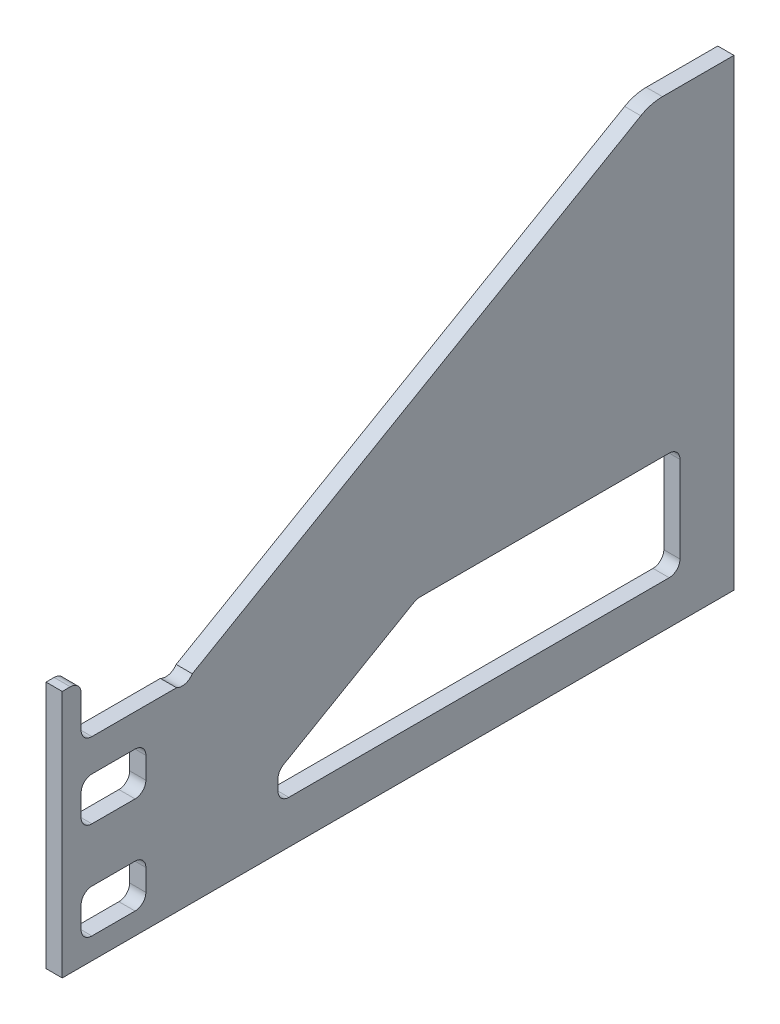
ISO-10303-21;
HEADER;
FILE_DESCRIPTION(('STEP AP214'),'2;1');
FILE_NAME('part.step','',(''),(''),'','','');
FILE_SCHEMA(('AUTOMOTIVE_DESIGN { 1 0 10303 214 1 1 1 1 }'));
ENDSEC;
DATA;
#1=APPLICATION_CONTEXT('core data for automotive mechanical design processes');
#2=APPLICATION_PROTOCOL_DEFINITION('international standard','automotive_design',2000,#1);
#3=PRODUCT_CONTEXT('',#1,'mechanical');
#4=PRODUCT('Part','Part','',(#3));
#5=PRODUCT_RELATED_PRODUCT_CATEGORY('part','',(#4));
#6=PRODUCT_DEFINITION_FORMATION('','',#4);
#7=PRODUCT_DEFINITION_CONTEXT('part definition',#1,'design');
#8=PRODUCT_DEFINITION('design','',#6,#7);
#9=PRODUCT_DEFINITION_SHAPE('','',#8);
#10=(LENGTH_UNIT() NAMED_UNIT(*) SI_UNIT(.MILLI.,.METRE.));
#11=(NAMED_UNIT(*) PLANE_ANGLE_UNIT() SI_UNIT($,.RADIAN.));
#12=(NAMED_UNIT(*) SI_UNIT($,.STERADIAN.) SOLID_ANGLE_UNIT());
#13=UNCERTAINTY_MEASURE_WITH_UNIT(LENGTH_MEASURE(1.E-05),#10,'distance_accuracy_value','');
#14=(GEOMETRIC_REPRESENTATION_CONTEXT(3) GLOBAL_UNCERTAINTY_ASSIGNED_CONTEXT((#13)) GLOBAL_UNIT_ASSIGNED_CONTEXT((#10,
#11,#12)) REPRESENTATION_CONTEXT('',''));
#15=CARTESIAN_POINT('',(0.,0.,0.));
#16=DIRECTION('',(0.,0.,1.));
#17=DIRECTION('',(1.,0.,0.));
#18=AXIS2_PLACEMENT_3D('',#15,#16,#17);
#19=CARTESIAN_POINT('',(4.7625,114.3,0.));
#20=DIRECTION('',(0.,-1.,0.));
#21=DIRECTION('',(0.,0.,-1.));
#22=AXIS2_PLACEMENT_3D('',#19,#20,#21);
#23=PLANE('',#22);
#24=DIRECTION('',(0.,0.,1.));
#25=VECTOR('',#24,1.);
#26=CARTESIAN_POINT('',(4.7625,114.3,0.));
#27=LINE('',#26,#25);
#28=CARTESIAN_POINT('',(4.7625,114.3,45.4431678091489));
#29=VERTEX_POINT('',#28);
#30=CARTESIAN_POINT('',(4.7625,114.3,95.2500000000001));
#31=VERTEX_POINT('',#30);
#32=EDGE_CURVE('E288',#29,#31,#27,.T.);
#33=ORIENTED_EDGE('',*,*,#32,.F.);
#34=DIRECTION('',(1.,0.,0.));
#35=VECTOR('',#34,1.);
#36=CARTESIAN_POINT('',(-4.7625,114.3,45.4431678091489));
#37=LINE('',#36,#35);
#38=CARTESIAN_POINT('',(-4.7625,114.3,45.4431678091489));
#39=VERTEX_POINT('',#38);
#40=EDGE_CURVE('E275',#29,#39,#37,.F.);
#41=ORIENTED_EDGE('',*,*,#40,.T.);
#42=DIRECTION('',(0.,0.,1.));
#43=VECTOR('',#42,1.);
#44=CARTESIAN_POINT('',(-4.7625,114.3,0.));
#45=LINE('',#44,#43);
#46=CARTESIAN_POINT('',(-4.7625,114.3,95.2500000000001));
#47=VERTEX_POINT('',#46);
#48=EDGE_CURVE('E315',#39,#47,#45,.T.);
#49=ORIENTED_EDGE('',*,*,#48,.T.);
#50=DIRECTION('',(-1.,0.,0.));
#51=VECTOR('',#50,1.);
#52=CARTESIAN_POINT('',(4.7625,114.3,95.2500000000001));
#53=LINE('',#52,#51);
#54=EDGE_CURVE('E294',#47,#31,#53,.F.);
#55=ORIENTED_EDGE('',*,*,#54,.T.);
#56=EDGE_LOOP('',(#33,#41,#49,#55));
#57=FACE_BOUND('',#56,.T.);
#58=ADVANCED_FACE('F33',(#57),#23,.F.);
#59=CARTESIAN_POINT('',(4.7625,114.3,112.7125));
#60=DIRECTION('',(0.,0.,-1.));
#61=DIRECTION('',(0.,1.,0.));
#62=AXIS2_PLACEMENT_3D('',#59,#60,#61);
#63=PLANE('',#62);
#64=DIRECTION('',(0.,-1.,0.));
#65=VECTOR('',#64,1.);
#66=CARTESIAN_POINT('',(-4.7625,114.3,112.7125));
#67=LINE('',#66,#65);
#68=CARTESIAN_POINT('',(-4.7625,146.05,112.7125));
#69=VERTEX_POINT('',#68);
#70=CARTESIAN_POINT('',(-4.7625,0.,112.7125));
#71=VERTEX_POINT('',#70);
#72=EDGE_CURVE('E317',#69,#71,#67,.T.);
#73=ORIENTED_EDGE('',*,*,#72,.T.);
#74=DIRECTION('',(-1.,0.,0.));
#75=VECTOR('',#74,1.);
#76=CARTESIAN_POINT('',(4.7625,0.,112.7125));
#77=LINE('',#76,#75);
#78=CARTESIAN_POINT('',(4.7625,0.,112.7125));
#79=VERTEX_POINT('',#78);
#80=EDGE_CURVE('E331',#79,#71,#77,.T.);
#81=ORIENTED_EDGE('',*,*,#80,.F.);
#82=DIRECTION('',(0.,-1.,0.));
#83=VECTOR('',#82,1.);
#84=CARTESIAN_POINT('',(4.7625,114.3,112.7125));
#85=LINE('',#84,#83);
#86=CARTESIAN_POINT('',(4.76250000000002,146.05,112.7125));
#87=VERTEX_POINT('',#86);
#88=EDGE_CURVE('E295',#87,#79,#85,.T.);
#89=ORIENTED_EDGE('',*,*,#88,.F.);
#90=DIRECTION('',(-1.,0.,0.));
#91=VECTOR('',#90,1.);
#92=CARTESIAN_POINT('',(38.4010219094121,146.05,112.7125));
#93=LINE('',#92,#91);
#94=EDGE_CURVE('E374',#87,#69,#93,.T.);
#95=ORIENTED_EDGE('',*,*,#94,.T.);
#96=EDGE_LOOP('',(#73,#81,#89,#95));
#97=FACE_BOUND('',#96,.T.);
#98=ADVANCED_FACE('F624',(#97),#63,.F.);
#99=CARTESIAN_POINT('',(4.7625,0.,112.7125));
#100=DIRECTION('',(0.,1.,0.));
#101=DIRECTION('',(0.,0.,1.));
#102=AXIS2_PLACEMENT_3D('',#99,#100,#101);
#103=PLANE('',#102);
#104=DIRECTION('',(0.,0.,-1.));
#105=VECTOR('',#104,1.);
#106=CARTESIAN_POINT('',(-4.7625,0.,112.7125));
#107=LINE('',#106,#105);
#108=CARTESIAN_POINT('',(-4.7625,0.,-282.575));
#109=VERTEX_POINT('',#108);
#110=EDGE_CURVE('E320',#71,#109,#107,.T.);
#111=ORIENTED_EDGE('',*,*,#110,.T.);
#112=DIRECTION('',(-1.,0.,0.));
#113=VECTOR('',#112,1.);
#114=CARTESIAN_POINT('',(4.7625,0.,-282.575));
#115=LINE('',#114,#113);
#116=CARTESIAN_POINT('',(4.7625,0.,-282.575));
#117=VERTEX_POINT('',#116);
#118=EDGE_CURVE('E328',#117,#109,#115,.T.);
#119=ORIENTED_EDGE('',*,*,#118,.F.);
#120=DIRECTION('',(0.,0.,-1.));
#121=VECTOR('',#120,1.);
#122=CARTESIAN_POINT('',(4.7625,0.,112.7125));
#123=LINE('',#122,#121);
#124=EDGE_CURVE('E298',#79,#117,#123,.T.);
#125=ORIENTED_EDGE('',*,*,#124,.F.);
#126=ORIENTED_EDGE('',*,*,#80,.T.);
#127=EDGE_LOOP('',(#111,#119,#125,#126));
#128=FACE_BOUND('',#127,.T.);
#129=ADVANCED_FACE('F629',(#128),#103,.F.);
#130=CARTESIAN_POINT('',(4.7625,0.,-282.575));
#131=DIRECTION('',(0.,0.,1.));
#132=DIRECTION('',(1.,0.,0.));
#133=AXIS2_PLACEMENT_3D('',#130,#131,#132);
#134=PLANE('',#133);
#135=DIRECTION('',(0.,1.,0.));
#136=VECTOR('',#135,1.);
#137=CARTESIAN_POINT('',(-4.7625,0.,-282.575));
#138=LINE('',#137,#136);
#139=CARTESIAN_POINT('',(-4.7625,272.576458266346,-282.575));
#140=VERTEX_POINT('',#139);
#141=EDGE_CURVE('E322',#109,#140,#138,.T.);
#142=ORIENTED_EDGE('',*,*,#141,.T.);
#143=DIRECTION('',(-1.,0.,0.));
#144=VECTOR('',#143,1.);
#145=CARTESIAN_POINT('',(4.7625,272.576458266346,-282.575));
#146=LINE('',#145,#144);
#147=CARTESIAN_POINT('',(4.7625,272.576458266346,-282.575));
#148=VERTEX_POINT('',#147);
#149=EDGE_CURVE('E314',#148,#140,#146,.T.);
#150=ORIENTED_EDGE('',*,*,#149,.F.);
#151=DIRECTION('',(0.,1.,0.));
#152=VECTOR('',#151,1.);
#153=CARTESIAN_POINT('',(4.7625,0.,-282.575));
#154=LINE('',#153,#152);
#155=EDGE_CURVE('E308',#117,#148,#154,.T.);
#156=ORIENTED_EDGE('',*,*,#155,.F.);
#157=ORIENTED_EDGE('',*,*,#118,.T.);
#158=EDGE_LOOP('',(#142,#150,#156,#157));
#159=FACE_BOUND('',#158,.T.);
#160=ADVANCED_FACE('F668',(#159),#134,.F.);
#161=CARTESIAN_POINT('',(4.7625,272.576458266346,-282.575));
#162=DIRECTION('',(0.,-1.,0.));
#163=DIRECTION('',(0.,0.,-1.));
#164=AXIS2_PLACEMENT_3D('',#161,#162,#163);
#165=PLANE('',#164);
#166=DIRECTION('',(0.,0.,1.));
#167=VECTOR('',#166,1.);
#168=CARTESIAN_POINT('',(-4.7625,272.576458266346,-282.575));
#169=LINE('',#168,#167);
#170=CARTESIAN_POINT('',(-4.7625,272.576458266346,-240.479801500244));
#171=VERTEX_POINT('',#170);
#172=EDGE_CURVE('E301',#140,#171,#169,.T.);
#173=ORIENTED_EDGE('',*,*,#172,.T.);
#174=DIRECTION('',(-1.,0.,0.));
#175=VECTOR('',#174,1.);
#176=CARTESIAN_POINT('',(4.7625,272.576458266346,-240.479801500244));
#177=LINE('',#176,#175);
#178=CARTESIAN_POINT('',(4.7625,272.576458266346,-240.479801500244));
#179=VERTEX_POINT('',#178);
#180=EDGE_CURVE('E348',#171,#179,#177,.F.);
#181=ORIENTED_EDGE('',*,*,#180,.T.);
#182=DIRECTION('',(0.,0.,1.));
#183=VECTOR('',#182,1.);
#184=CARTESIAN_POINT('',(4.7625,272.576458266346,-282.575));
#185=LINE('',#184,#183);
#186=EDGE_CURVE('E310',#148,#179,#185,.T.);
#187=ORIENTED_EDGE('',*,*,#186,.F.);
#188=ORIENTED_EDGE('',*,*,#149,.T.);
#189=EDGE_LOOP('',(#173,#181,#187,#188));
#190=FACE_BOUND('',#189,.T.);
#191=ADVANCED_FACE('F671',(#190),#165,.F.);
#192=CARTESIAN_POINT('',(4.7625,272.576458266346,-233.673892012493));
#193=DIRECTION('',(0.,-0.866025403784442,-0.499999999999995));
#194=DIRECTION('',(0.,0.499999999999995,-0.866025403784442));
#195=AXIS2_PLACEMENT_3D('',#192,#193,#194);
#196=PLANE('',#195);
#197=DIRECTION('',(0.,-0.499999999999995,0.866025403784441));
#198=VECTOR('',#197,1.);
#199=CARTESIAN_POINT('',(-4.7625,272.576458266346,-233.673892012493));
#200=LINE('',#199,#198);
#201=CARTESIAN_POINT('',(-4.7625,269.173503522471,-227.779801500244));
#202=VERTEX_POINT('',#201);
#203=CARTESIAN_POINT('',(-4.7625,116.787096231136,36.1611983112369));
#204=VERTEX_POINT('',#203);
#205=EDGE_CURVE('E296',#202,#204,#200,.T.);
#206=ORIENTED_EDGE('',*,*,#205,.T.);
#207=DIRECTION('',(1.,0.,0.));
#208=VECTOR('',#207,1.);
#209=CARTESIAN_POINT('',(-4.7625,116.787096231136,36.1611983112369));
#210=LINE('',#209,#208);
#211=CARTESIAN_POINT('',(4.7625,116.787096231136,36.1611983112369));
#212=VERTEX_POINT('',#211);
#213=EDGE_CURVE('E48',#204,#212,#210,.T.);
#214=ORIENTED_EDGE('',*,*,#213,.T.);
#215=DIRECTION('',(0.,-0.499999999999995,0.866025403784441));
#216=VECTOR('',#215,1.);
#217=CARTESIAN_POINT('',(4.7625,272.576458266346,-233.673892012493));
#218=LINE('',#217,#216);
#219=CARTESIAN_POINT('',(4.7625,269.173503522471,-227.779801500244));
#220=VERTEX_POINT('',#219);
#221=EDGE_CURVE('E291',#220,#212,#218,.T.);
#222=ORIENTED_EDGE('',*,*,#221,.F.);
#223=DIRECTION('',(-1.,0.,0.));
#224=VECTOR('',#223,1.);
#225=CARTESIAN_POINT('',(4.7625,269.173503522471,-227.779801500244));
#226=LINE('',#225,#224);
#227=EDGE_CURVE('E343',#220,#202,#226,.T.);
#228=ORIENTED_EDGE('',*,*,#227,.T.);
#229=EDGE_LOOP('',(#206,#214,#222,#228));
#230=FACE_BOUND('',#229,.T.);
#231=ADVANCED_FACE('F648',(#230),#196,.F.);
#232=CARTESIAN_POINT('',(4.7625,0.,0.));
#233=DIRECTION('',(1.,0.,0.));
#234=DIRECTION('',(0.,0.,-1.));
#235=AXIS2_PLACEMENT_3D('',#232,#233,#234);
#236=PLANE('',#235);
#237=CARTESIAN_POINT('',(4.7625,120.65,42.1704527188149));
#238=DIRECTION('',(1.,0.,0.));
#239=DIRECTION('',(0.,0.,-1.));
#240=AXIS2_PLACEMENT_3D('',#237,#238,#239);
#241=CIRCLE('',#240,7.14375000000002);
#242=EDGE_CURVE('E278',#29,#212,#241,.T.);
#243=ORIENTED_EDGE('',*,*,#242,.F.);
#244=ORIENTED_EDGE('',*,*,#32,.T.);
#245=CARTESIAN_POINT('',(4.7625,120.65,95.2500000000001));
#246=DIRECTION('',(1.,0.,0.));
#247=DIRECTION('',(0.,0.,-1.));
#248=AXIS2_PLACEMENT_3D('',#245,#246,#247);
#249=CIRCLE('',#248,6.35);
#250=CARTESIAN_POINT('',(4.7625,120.65,101.6));
#251=VERTEX_POINT('',#250);
#252=EDGE_CURVE('E11',#31,#251,#249,.F.);
#253=ORIENTED_EDGE('',*,*,#252,.T.);
#254=DIRECTION('',(0.,-1.,0.));
#255=VECTOR('',#254,1.);
#256=CARTESIAN_POINT('',(4.7625,146.05,101.6));
#257=LINE('',#256,#255);
#258=CARTESIAN_POINT('',(4.7625,139.7,101.6));
#259=VERTEX_POINT('',#258);
#260=EDGE_CURVE('E366',#259,#251,#257,.T.);
#261=ORIENTED_EDGE('',*,*,#260,.F.);
#262=CARTESIAN_POINT('',(4.7625,139.7,107.95));
#263=DIRECTION('',(1.,0.,0.));
#264=DIRECTION('',(0.,0.,-1.));
#265=AXIS2_PLACEMENT_3D('',#262,#263,#264);
#266=CIRCLE('',#265,6.35);
#267=CARTESIAN_POINT('',(4.7625,146.05,107.95));
#268=VERTEX_POINT('',#267);
#269=EDGE_CURVE('E341',#259,#268,#266,.T.);
#270=ORIENTED_EDGE('',*,*,#269,.T.);
#271=DIRECTION('',(0.,0.,-1.));
#272=VECTOR('',#271,1.);
#273=CARTESIAN_POINT('',(4.7625,146.05,112.7125));
#274=LINE('',#273,#272);
#275=EDGE_CURVE('E369',#87,#268,#274,.T.);
#276=ORIENTED_EDGE('',*,*,#275,.F.);
#277=ORIENTED_EDGE('',*,*,#88,.T.);
#278=ORIENTED_EDGE('',*,*,#124,.T.);
#279=ORIENTED_EDGE('',*,*,#155,.T.);
#280=ORIENTED_EDGE('',*,*,#186,.T.);
#281=CARTESIAN_POINT('',(4.7625,247.176458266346,-240.479801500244));
#282=DIRECTION('',(1.,0.,0.));
#283=DIRECTION('',(0.,0.,-1.));
#284=AXIS2_PLACEMENT_3D('',#281,#282,#283);
#285=CIRCLE('',#284,25.4);
#286=EDGE_CURVE('E350',#179,#220,#285,.T.);
#287=ORIENTED_EDGE('',*,*,#286,.T.);
#288=ORIENTED_EDGE('',*,*,#221,.T.);
#289=EDGE_LOOP('',(#243,#244,#253,#261,#270,#276,#277,#278,#279,#280,#287,#288));
#290=FACE_BOUND('',#289,.T.);
#291=CARTESIAN_POINT('',(4.7625,82.55,-97.6271583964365));
#292=DIRECTION('',(1.,0.,0.));
#293=DIRECTION('',(0.,0.,-1.));
#294=AXIS2_PLACEMENT_3D('',#291,#292,#293);
#295=CIRCLE('',#294,6.34999999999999);
#296=CARTESIAN_POINT('',(4.7625,88.9,-97.6271583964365));
#297=VERTEX_POINT('',#296);
#298=CARTESIAN_POINT('',(4.7625,88.0492613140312,-94.4521583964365));
#299=VERTEX_POINT('',#298);
#300=EDGE_CURVE('E368',#297,#299,#295,.T.);
#301=ORIENTED_EDGE('',*,*,#300,.F.);
#302=DIRECTION('',(0.,0.,1.));
#303=VECTOR('',#302,1.);
#304=CARTESIAN_POINT('',(4.7625,88.9,-97.6271583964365));
#305=LINE('',#304,#303);
#306=CARTESIAN_POINT('',(4.7625,88.9,-244.475));
#307=VERTEX_POINT('',#306);
#308=EDGE_CURVE('E385',#307,#297,#305,.T.);
#309=ORIENTED_EDGE('',*,*,#308,.F.);
#310=CARTESIAN_POINT('',(4.7625,82.55,-244.475));
#311=DIRECTION('',(1.,0.,0.));
#312=DIRECTION('',(0.,0.,-1.));
#313=AXIS2_PLACEMENT_3D('',#310,#311,#312);
#314=CIRCLE('',#313,6.34999999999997);
#315=CARTESIAN_POINT('',(4.7625,82.55,-250.825));
#316=VERTEX_POINT('',#315);
#317=EDGE_CURVE('E433',#316,#307,#314,.T.);
#318=ORIENTED_EDGE('',*,*,#317,.F.);
#319=DIRECTION('',(0.,1.,0.));
#320=VECTOR('',#319,1.);
#321=CARTESIAN_POINT('',(4.7625,82.55,-250.825));
#322=LINE('',#321,#320);
#323=CARTESIAN_POINT('',(4.7625,31.75,-250.825));
#324=VERTEX_POINT('',#323);
#325=EDGE_CURVE('E430',#324,#316,#322,.T.);
#326=ORIENTED_EDGE('',*,*,#325,.F.);
#327=CARTESIAN_POINT('',(4.7625,31.75,-244.475));
#328=DIRECTION('',(1.,0.,0.));
#329=DIRECTION('',(0.,0.,-1.));
#330=AXIS2_PLACEMENT_3D('',#327,#328,#329);
#331=CIRCLE('',#330,6.34999999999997);
#332=CARTESIAN_POINT('',(4.7625,25.4,-244.475));
#333=VERTEX_POINT('',#332);
#334=EDGE_CURVE('E427',#333,#324,#331,.T.);
#335=ORIENTED_EDGE('',*,*,#334,.F.);
#336=DIRECTION('',(0.,0.,-1.));
#337=VECTOR('',#336,1.);
#338=CARTESIAN_POINT('',(4.7625,25.4,-20.6374999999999));
#339=LINE('',#338,#337);
#340=CARTESIAN_POINT('',(4.7625,25.4,-20.6374999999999));
#341=VERTEX_POINT('',#340);
#342=EDGE_CURVE('E424',#341,#333,#339,.T.);
#343=ORIENTED_EDGE('',*,*,#342,.F.);
#344=CARTESIAN_POINT('',(4.7625,31.75,-20.6374999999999));
#345=DIRECTION('',(1.,0.,0.));
#346=DIRECTION('',(0.,0.,-1.));
#347=AXIS2_PLACEMENT_3D('',#344,#345,#346);
#348=CIRCLE('',#347,6.35);
#349=CARTESIAN_POINT('',(4.7625,31.75,-14.2874999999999));
#350=VERTEX_POINT('',#349);
#351=EDGE_CURVE('E421',#350,#341,#348,.T.);
#352=ORIENTED_EDGE('',*,*,#351,.F.);
#353=DIRECTION('',(0.,-1.,0.));
#354=VECTOR('',#353,1.);
#355=CARTESIAN_POINT('',(4.7625,38.1,-14.2874999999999));
#356=LINE('',#355,#354);
#357=CARTESIAN_POINT('',(4.7625,38.1,-14.2874999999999));
#358=VERTEX_POINT('',#357);
#359=EDGE_CURVE('E418',#358,#350,#356,.T.);
#360=ORIENTED_EDGE('',*,*,#359,.F.);
#361=CARTESIAN_POINT('',(4.7625,38.1,-20.6374999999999));
#362=DIRECTION('',(1.,0.,0.));
#363=DIRECTION('',(0.,0.,-1.));
#364=AXIS2_PLACEMENT_3D('',#361,#362,#363);
#365=CIRCLE('',#364,6.35);
#366=CARTESIAN_POINT('',(4.7625,43.5992613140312,-17.4624999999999));
#367=VERTEX_POINT('',#366);
#368=EDGE_CURVE('E415',#367,#358,#365,.T.);
#369=ORIENTED_EDGE('',*,*,#368,.F.);
#370=DIRECTION('',(0.,-0.5,0.866025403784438));
#371=VECTOR('',#370,1.);
#372=CARTESIAN_POINT('',(4.7625,88.0492613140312,-94.4521583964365));
#373=LINE('',#372,#371);
#374=EDGE_CURVE('E371',#299,#367,#373,.T.);
#375=ORIENTED_EDGE('',*,*,#374,.F.);
#376=EDGE_LOOP('',(#301,#309,#318,#326,#335,#343,#352,#360,#369,#375));
#377=FACE_BOUND('',#376,.T.);
#378=CARTESIAN_POINT('',(4.7625,76.2,95.2500000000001));
#379=DIRECTION('',(1.,0.,0.));
#380=DIRECTION('',(0.,0.,-1.));
#381=AXIS2_PLACEMENT_3D('',#378,#379,#380);
#382=CIRCLE('',#381,6.35);
#383=CARTESIAN_POINT('',(4.7625,76.2,101.6));
#384=VERTEX_POINT('',#383);
#385=CARTESIAN_POINT('',(4.7625,69.85,95.2500000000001));
#386=VERTEX_POINT('',#385);
#387=EDGE_CURVE('E440',#384,#386,#382,.T.);
#388=ORIENTED_EDGE('',*,*,#387,.F.);
#389=DIRECTION('',(0.,-1.,0.));
#390=VECTOR('',#389,1.);
#391=CARTESIAN_POINT('',(4.7625,88.9,101.6));
#392=LINE('',#391,#390);
#393=CARTESIAN_POINT('',(4.7625,88.9,101.6));
#394=VERTEX_POINT('',#393);
#395=EDGE_CURVE('E463',#394,#384,#392,.T.);
#396=ORIENTED_EDGE('',*,*,#395,.F.);
#397=CARTESIAN_POINT('',(4.7625,88.9,95.2500000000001));
#398=DIRECTION('',(1.,0.,0.));
#399=DIRECTION('',(0.,0.,-1.));
#400=AXIS2_PLACEMENT_3D('',#397,#398,#399);
#401=CIRCLE('',#400,6.34999999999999);
#402=CARTESIAN_POINT('',(4.7625,95.25,95.2500000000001));
#403=VERTEX_POINT('',#402);
#404=EDGE_CURVE('E501',#403,#394,#401,.T.);
#405=ORIENTED_EDGE('',*,*,#404,.F.);
#406=DIRECTION('',(0.,0.,1.));
#407=VECTOR('',#406,1.);
#408=CARTESIAN_POINT('',(4.7625,95.25,95.2500000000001));
#409=LINE('',#408,#407);
#410=CARTESIAN_POINT('',(4.7625,95.25,69.8500000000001));
#411=VERTEX_POINT('',#410);
#412=EDGE_CURVE('E498',#411,#403,#409,.T.);
#413=ORIENTED_EDGE('',*,*,#412,.F.);
#414=CARTESIAN_POINT('',(4.7625,88.9,69.8500000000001));
#415=DIRECTION('',(1.,0.,0.));
#416=DIRECTION('',(0.,0.,1.));
#417=AXIS2_PLACEMENT_3D('',#414,#415,#416);
#418=CIRCLE('',#417,6.34999999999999);
#419=CARTESIAN_POINT('',(4.7625,88.9,63.5000000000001));
#420=VERTEX_POINT('',#419);
#421=EDGE_CURVE('E495',#420,#411,#418,.T.);
#422=ORIENTED_EDGE('',*,*,#421,.F.);
#423=DIRECTION('',(0.,1.,0.));
#424=VECTOR('',#423,1.);
#425=CARTESIAN_POINT('',(4.7625,88.9,63.5000000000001));
#426=LINE('',#425,#424);
#427=CARTESIAN_POINT('',(4.7625,76.2,63.5000000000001));
#428=VERTEX_POINT('',#427);
#429=EDGE_CURVE('E492',#428,#420,#426,.T.);
#430=ORIENTED_EDGE('',*,*,#429,.F.);
#431=CARTESIAN_POINT('',(4.7625,76.2,69.8500000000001));
#432=DIRECTION('',(1.,0.,0.));
#433=DIRECTION('',(0.,0.,-1.));
#434=AXIS2_PLACEMENT_3D('',#431,#432,#433);
#435=CIRCLE('',#434,6.35000000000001);
#436=CARTESIAN_POINT('',(4.7625,69.85,69.8500000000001));
#437=VERTEX_POINT('',#436);
#438=EDGE_CURVE('E489',#437,#428,#435,.T.);
#439=ORIENTED_EDGE('',*,*,#438,.F.);
#440=DIRECTION('',(0.,0.,-1.));
#441=VECTOR('',#440,1.);
#442=CARTESIAN_POINT('',(4.7625,69.85,95.2500000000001));
#443=LINE('',#442,#441);
#444=EDGE_CURVE('E486',#386,#437,#443,.T.);
#445=ORIENTED_EDGE('',*,*,#444,.F.);
#446=EDGE_LOOP('',(#388,#396,#405,#413,#422,#430,#439,#445));
#447=FACE_BOUND('',#446,.T.);
#448=CARTESIAN_POINT('',(4.7625,31.75,95.2500000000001));
#449=DIRECTION('',(1.,0.,0.));
#450=DIRECTION('',(0.,0.,-1.));
#451=AXIS2_PLACEMENT_3D('',#448,#449,#450);
#452=CIRCLE('',#451,6.35);
#453=CARTESIAN_POINT('',(4.7625,38.1,95.2500000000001));
#454=VERTEX_POINT('',#453);
#455=CARTESIAN_POINT('',(4.7625,31.75,101.6));
#456=VERTEX_POINT('',#455);
#457=EDGE_CURVE('E508',#454,#456,#452,.T.);
#458=ORIENTED_EDGE('',*,*,#457,.F.);
#459=DIRECTION('',(0.,0.,1.));
#460=VECTOR('',#459,1.);
#461=CARTESIAN_POINT('',(4.7625,38.1,95.2500000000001));
#462=LINE('',#461,#460);
#463=CARTESIAN_POINT('',(4.7625,38.1,69.8500000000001));
#464=VERTEX_POINT('',#463);
#465=EDGE_CURVE('E527',#464,#454,#462,.T.);
#466=ORIENTED_EDGE('',*,*,#465,.F.);
#467=CARTESIAN_POINT('',(4.7625,31.75,69.8500000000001));
#468=DIRECTION('',(1.,0.,0.));
#469=DIRECTION('',(0.,0.,-1.));
#470=AXIS2_PLACEMENT_3D('',#467,#468,#469);
#471=CIRCLE('',#470,6.34999999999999);
#472=CARTESIAN_POINT('',(4.7625,31.75,63.5000000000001));
#473=VERTEX_POINT('',#472);
#474=EDGE_CURVE('E564',#473,#464,#471,.T.);
#475=ORIENTED_EDGE('',*,*,#474,.F.);
#476=DIRECTION('',(0.,1.,0.));
#477=VECTOR('',#476,1.);
#478=CARTESIAN_POINT('',(4.7625,31.75,63.5000000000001));
#479=LINE('',#478,#477);
#480=CARTESIAN_POINT('',(4.7625,19.05,63.5000000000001));
#481=VERTEX_POINT('',#480);
#482=EDGE_CURVE('E561',#481,#473,#479,.T.);
#483=ORIENTED_EDGE('',*,*,#482,.F.);
#484=CARTESIAN_POINT('',(4.7625,19.05,69.8500000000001));
#485=DIRECTION('',(1.,0.,0.));
#486=DIRECTION('',(0.,0.,-1.));
#487=AXIS2_PLACEMENT_3D('',#484,#485,#486);
#488=CIRCLE('',#487,6.35);
#489=CARTESIAN_POINT('',(4.7625,12.7,69.8500000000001));
#490=VERTEX_POINT('',#489);
#491=EDGE_CURVE('E558',#490,#481,#488,.T.);
#492=ORIENTED_EDGE('',*,*,#491,.F.);
#493=DIRECTION('',(0.,0.,-1.));
#494=VECTOR('',#493,1.);
#495=CARTESIAN_POINT('',(4.7625,12.7,95.2500000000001));
#496=LINE('',#495,#494);
#497=CARTESIAN_POINT('',(4.7625,12.7,95.2500000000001));
#498=VERTEX_POINT('',#497);
#499=EDGE_CURVE('E555',#498,#490,#496,.T.);
#500=ORIENTED_EDGE('',*,*,#499,.F.);
#501=CARTESIAN_POINT('',(4.7625,19.05,95.2500000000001));
#502=DIRECTION('',(1.,0.,0.));
#503=DIRECTION('',(0.,0.,-1.));
#504=AXIS2_PLACEMENT_3D('',#501,#502,#503);
#505=CIRCLE('',#504,6.35);
#506=CARTESIAN_POINT('',(4.7625,19.05,101.6));
#507=VERTEX_POINT('',#506);
#508=EDGE_CURVE('E552',#507,#498,#505,.T.);
#509=ORIENTED_EDGE('',*,*,#508,.F.);
#510=DIRECTION('',(0.,-1.,0.));
#511=VECTOR('',#510,1.);
#512=CARTESIAN_POINT('',(4.7625,31.75,101.6));
#513=LINE('',#512,#511);
#514=EDGE_CURVE('E549',#456,#507,#513,.T.);
#515=ORIENTED_EDGE('',*,*,#514,.F.);
#516=EDGE_LOOP('',(#458,#466,#475,#483,#492,#500,#509,#515));
#517=FACE_BOUND('',#516,.T.);
#518=ADVANCED_FACE('F286',(#290,#377,#447,#517),#236,.T.);
#519=CARTESIAN_POINT('',(-4.7625,0.,0.));
#520=DIRECTION('',(1.,0.,0.));
#521=DIRECTION('',(0.,0.,-1.));
#522=AXIS2_PLACEMENT_3D('',#519,#520,#521);
#523=PLANE('',#522);
#524=DIRECTION('',(0.,0.,1.));
#525=VECTOR('',#524,1.);
#526=CARTESIAN_POINT('',(-4.7625,88.9,-97.6271583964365));
#527=LINE('',#526,#525);
#528=CARTESIAN_POINT('',(-4.7625,88.9,-244.475));
#529=VERTEX_POINT('',#528);
#530=CARTESIAN_POINT('',(-4.7625,88.9,-97.6271583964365));
#531=VERTEX_POINT('',#530);
#532=EDGE_CURVE('E409',#529,#531,#527,.T.);
#533=ORIENTED_EDGE('',*,*,#532,.T.);
#534=CARTESIAN_POINT('',(-4.7625,82.55,-97.6271583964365));
#535=DIRECTION('',(1.,0.,0.));
#536=DIRECTION('',(0.,0.,-1.));
#537=AXIS2_PLACEMENT_3D('',#534,#535,#536);
#538=CIRCLE('',#537,6.34999999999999);
#539=CARTESIAN_POINT('',(-4.7625,88.0492613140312,-94.4521583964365));
#540=VERTEX_POINT('',#539);
#541=EDGE_CURVE('E381',#531,#540,#538,.T.);
#542=ORIENTED_EDGE('',*,*,#541,.T.);
#543=DIRECTION('',(0.,-0.5,0.866025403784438));
#544=VECTOR('',#543,1.);
#545=CARTESIAN_POINT('',(-4.7625,88.0492613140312,-94.4521583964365));
#546=LINE('',#545,#544);
#547=CARTESIAN_POINT('',(-4.7625,43.5992613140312,-17.4624999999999));
#548=VERTEX_POINT('',#547);
#549=EDGE_CURVE('E384',#540,#548,#546,.T.);
#550=ORIENTED_EDGE('',*,*,#549,.T.);
#551=CARTESIAN_POINT('',(-4.7625,38.1,-20.6374999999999));
#552=DIRECTION('',(1.,0.,0.));
#553=DIRECTION('',(0.,0.,-1.));
#554=AXIS2_PLACEMENT_3D('',#551,#552,#553);
#555=CIRCLE('',#554,6.35);
#556=CARTESIAN_POINT('',(-4.7625,38.1,-14.2874999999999));
#557=VERTEX_POINT('',#556);
#558=EDGE_CURVE('E388',#548,#557,#555,.T.);
#559=ORIENTED_EDGE('',*,*,#558,.T.);
#560=DIRECTION('',(0.,-1.,0.));
#561=VECTOR('',#560,1.);
#562=CARTESIAN_POINT('',(-4.7625,38.1,-14.2874999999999));
#563=LINE('',#562,#561);
#564=CARTESIAN_POINT('',(-4.7625,31.75,-14.2874999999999));
#565=VERTEX_POINT('',#564);
#566=EDGE_CURVE('E391',#557,#565,#563,.T.);
#567=ORIENTED_EDGE('',*,*,#566,.T.);
#568=CARTESIAN_POINT('',(-4.7625,31.75,-20.6374999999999));
#569=DIRECTION('',(1.,0.,0.));
#570=DIRECTION('',(0.,0.,-1.));
#571=AXIS2_PLACEMENT_3D('',#568,#569,#570);
#572=CIRCLE('',#571,6.35);
#573=CARTESIAN_POINT('',(-4.7625,25.4,-20.6374999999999));
#574=VERTEX_POINT('',#573);
#575=EDGE_CURVE('E394',#565,#574,#572,.T.);
#576=ORIENTED_EDGE('',*,*,#575,.T.);
#577=DIRECTION('',(0.,0.,-1.));
#578=VECTOR('',#577,1.);
#579=CARTESIAN_POINT('',(-4.7625,25.4,-20.6374999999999));
#580=LINE('',#579,#578);
#581=CARTESIAN_POINT('',(-4.7625,25.4,-244.475));
#582=VERTEX_POINT('',#581);
#583=EDGE_CURVE('E397',#574,#582,#580,.T.);
#584=ORIENTED_EDGE('',*,*,#583,.T.);
#585=CARTESIAN_POINT('',(-4.7625,31.75,-244.475));
#586=DIRECTION('',(1.,0.,0.));
#587=DIRECTION('',(0.,0.,-1.));
#588=AXIS2_PLACEMENT_3D('',#585,#586,#587);
#589=CIRCLE('',#588,6.34999999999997);
#590=CARTESIAN_POINT('',(-4.7625,31.75,-250.825));
#591=VERTEX_POINT('',#590);
#592=EDGE_CURVE('E400',#582,#591,#589,.T.);
#593=ORIENTED_EDGE('',*,*,#592,.T.);
#594=DIRECTION('',(0.,1.,0.));
#595=VECTOR('',#594,1.);
#596=CARTESIAN_POINT('',(-4.7625,82.55,-250.825));
#597=LINE('',#596,#595);
#598=CARTESIAN_POINT('',(-4.7625,82.55,-250.825));
#599=VERTEX_POINT('',#598);
#600=EDGE_CURVE('E403',#591,#599,#597,.T.);
#601=ORIENTED_EDGE('',*,*,#600,.T.);
#602=CARTESIAN_POINT('',(-4.7625,82.55,-244.475));
#603=DIRECTION('',(1.,0.,0.));
#604=DIRECTION('',(0.,0.,-1.));
#605=AXIS2_PLACEMENT_3D('',#602,#603,#604);
#606=CIRCLE('',#605,6.34999999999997);
#607=EDGE_CURVE('E406',#599,#529,#606,.T.);
#608=ORIENTED_EDGE('',*,*,#607,.T.);
#609=EDGE_LOOP('',(#533,#542,#550,#559,#567,#576,#584,#593,#601,#608));
#610=FACE_BOUND('',#609,.T.);
#611=DIRECTION('',(0.,-1.,0.));
#612=VECTOR('',#611,1.);
#613=CARTESIAN_POINT('',(-4.7625,88.9,101.6));
#614=LINE('',#613,#612);
#615=CARTESIAN_POINT('',(-4.7625,88.9,101.6));
#616=VERTEX_POINT('',#615);
#617=CARTESIAN_POINT('',(-4.7625,76.2,101.6));
#618=VERTEX_POINT('',#617);
#619=EDGE_CURVE('E481',#616,#618,#614,.T.);
#620=ORIENTED_EDGE('',*,*,#619,.T.);
#621=CARTESIAN_POINT('',(-4.7625,76.2,95.2500000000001));
#622=DIRECTION('',(1.,0.,0.));
#623=DIRECTION('',(0.,0.,-1.));
#624=AXIS2_PLACEMENT_3D('',#621,#622,#623);
#625=CIRCLE('',#624,6.35);
#626=CARTESIAN_POINT('',(-4.7625,69.85,95.2500000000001));
#627=VERTEX_POINT('',#626);
#628=EDGE_CURVE('E459',#618,#627,#625,.T.);
#629=ORIENTED_EDGE('',*,*,#628,.T.);
#630=DIRECTION('',(0.,0.,-1.));
#631=VECTOR('',#630,1.);
#632=CARTESIAN_POINT('',(-4.7625,69.85,95.2500000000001));
#633=LINE('',#632,#631);
#634=CARTESIAN_POINT('',(-4.7625,69.85,69.8500000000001));
#635=VERTEX_POINT('',#634);
#636=EDGE_CURVE('E462',#627,#635,#633,.T.);
#637=ORIENTED_EDGE('',*,*,#636,.T.);
#638=CARTESIAN_POINT('',(-4.7625,76.2,69.8500000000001));
#639=DIRECTION('',(1.,0.,0.));
#640=DIRECTION('',(0.,0.,-1.));
#641=AXIS2_PLACEMENT_3D('',#638,#639,#640);
#642=CIRCLE('',#641,6.35000000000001);
#643=CARTESIAN_POINT('',(-4.7625,76.2,63.5000000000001));
#644=VERTEX_POINT('',#643);
#645=EDGE_CURVE('E466',#635,#644,#642,.T.);
#646=ORIENTED_EDGE('',*,*,#645,.T.);
#647=DIRECTION('',(0.,1.,0.));
#648=VECTOR('',#647,1.);
#649=CARTESIAN_POINT('',(-4.7625,88.9,63.5000000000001));
#650=LINE('',#649,#648);
#651=CARTESIAN_POINT('',(-4.7625,88.9,63.5000000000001));
#652=VERTEX_POINT('',#651);
#653=EDGE_CURVE('E469',#644,#652,#650,.T.);
#654=ORIENTED_EDGE('',*,*,#653,.T.);
#655=CARTESIAN_POINT('',(-4.7625,88.9,69.8500000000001));
#656=DIRECTION('',(1.,0.,0.));
#657=DIRECTION('',(0.,0.,1.));
#658=AXIS2_PLACEMENT_3D('',#655,#656,#657);
#659=CIRCLE('',#658,6.34999999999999);
#660=CARTESIAN_POINT('',(-4.7625,95.25,69.8500000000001));
#661=VERTEX_POINT('',#660);
#662=EDGE_CURVE('E472',#652,#661,#659,.T.);
#663=ORIENTED_EDGE('',*,*,#662,.T.);
#664=DIRECTION('',(0.,0.,1.));
#665=VECTOR('',#664,1.);
#666=CARTESIAN_POINT('',(-4.7625,95.25,95.2500000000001));
#667=LINE('',#666,#665);
#668=CARTESIAN_POINT('',(-4.7625,95.25,95.2500000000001));
#669=VERTEX_POINT('',#668);
#670=EDGE_CURVE('E475',#661,#669,#667,.T.);
#671=ORIENTED_EDGE('',*,*,#670,.T.);
#672=CARTESIAN_POINT('',(-4.7625,88.9,95.2500000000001));
#673=DIRECTION('',(1.,0.,0.));
#674=DIRECTION('',(0.,0.,-1.));
#675=AXIS2_PLACEMENT_3D('',#672,#673,#674);
#676=CIRCLE('',#675,6.34999999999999);
#677=EDGE_CURVE('E478',#669,#616,#676,.T.);
#678=ORIENTED_EDGE('',*,*,#677,.T.);
#679=EDGE_LOOP('',(#620,#629,#637,#646,#654,#663,#671,#678));
#680=FACE_BOUND('',#679,.T.);
#681=DIRECTION('',(0.,0.,1.));
#682=VECTOR('',#681,1.);
#683=CARTESIAN_POINT('',(-4.7625,38.1,95.2500000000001));
#684=LINE('',#683,#682);
#685=CARTESIAN_POINT('',(-4.7625,38.1,69.8500000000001));
#686=VERTEX_POINT('',#685);
#687=CARTESIAN_POINT('',(-4.7625,38.1,95.2500000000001));
#688=VERTEX_POINT('',#687);
#689=EDGE_CURVE('E545',#686,#688,#684,.T.);
#690=ORIENTED_EDGE('',*,*,#689,.T.);
#691=CARTESIAN_POINT('',(-4.7625,31.75,95.2500000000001));
#692=DIRECTION('',(1.,0.,0.));
#693=DIRECTION('',(0.,0.,-1.));
#694=AXIS2_PLACEMENT_3D('',#691,#692,#693);
#695=CIRCLE('',#694,6.35);
#696=CARTESIAN_POINT('',(-4.7625,31.75,101.6));
#697=VERTEX_POINT('',#696);
#698=EDGE_CURVE('E523',#688,#697,#695,.T.);
#699=ORIENTED_EDGE('',*,*,#698,.T.);
#700=DIRECTION('',(0.,-1.,0.));
#701=VECTOR('',#700,1.);
#702=CARTESIAN_POINT('',(-4.7625,31.75,101.6));
#703=LINE('',#702,#701);
#704=CARTESIAN_POINT('',(-4.7625,19.05,101.6));
#705=VERTEX_POINT('',#704);
#706=EDGE_CURVE('E526',#697,#705,#703,.T.);
#707=ORIENTED_EDGE('',*,*,#706,.T.);
#708=CARTESIAN_POINT('',(-4.7625,19.05,95.2500000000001));
#709=DIRECTION('',(1.,0.,0.));
#710=DIRECTION('',(0.,0.,-1.));
#711=AXIS2_PLACEMENT_3D('',#708,#709,#710);
#712=CIRCLE('',#711,6.35);
#713=CARTESIAN_POINT('',(-4.7625,12.7,95.2500000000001));
#714=VERTEX_POINT('',#713);
#715=EDGE_CURVE('E530',#705,#714,#712,.T.);
#716=ORIENTED_EDGE('',*,*,#715,.T.);
#717=DIRECTION('',(0.,0.,-1.));
#718=VECTOR('',#717,1.);
#719=CARTESIAN_POINT('',(-4.7625,12.7,95.2500000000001));
#720=LINE('',#719,#718);
#721=CARTESIAN_POINT('',(-4.7625,12.7,69.8500000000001));
#722=VERTEX_POINT('',#721);
#723=EDGE_CURVE('E533',#714,#722,#720,.T.);
#724=ORIENTED_EDGE('',*,*,#723,.T.);
#725=CARTESIAN_POINT('',(-4.7625,19.05,69.8500000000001));
#726=DIRECTION('',(1.,0.,0.));
#727=DIRECTION('',(0.,0.,-1.));
#728=AXIS2_PLACEMENT_3D('',#725,#726,#727);
#729=CIRCLE('',#728,6.35);
#730=CARTESIAN_POINT('',(-4.7625,19.05,63.5000000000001));
#731=VERTEX_POINT('',#730);
#732=EDGE_CURVE('E536',#722,#731,#729,.T.);
#733=ORIENTED_EDGE('',*,*,#732,.T.);
#734=DIRECTION('',(0.,1.,0.));
#735=VECTOR('',#734,1.);
#736=CARTESIAN_POINT('',(-4.7625,31.75,63.5000000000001));
#737=LINE('',#736,#735);
#738=CARTESIAN_POINT('',(-4.7625,31.75,63.5000000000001));
#739=VERTEX_POINT('',#738);
#740=EDGE_CURVE('E539',#731,#739,#737,.T.);
#741=ORIENTED_EDGE('',*,*,#740,.T.);
#742=CARTESIAN_POINT('',(-4.7625,31.75,69.8500000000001));
#743=DIRECTION('',(1.,0.,0.));
#744=DIRECTION('',(0.,0.,-1.));
#745=AXIS2_PLACEMENT_3D('',#742,#743,#744);
#746=CIRCLE('',#745,6.34999999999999);
#747=EDGE_CURVE('E542',#739,#686,#746,.T.);
#748=ORIENTED_EDGE('',*,*,#747,.T.);
#749=EDGE_LOOP('',(#690,#699,#707,#716,#724,#733,#741,#748));
#750=FACE_BOUND('',#749,.T.);
#751=ORIENTED_EDGE('',*,*,#48,.F.);
#752=CARTESIAN_POINT('',(-4.7625,120.65,42.1704527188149));
#753=DIRECTION('',(1.,0.,0.));
#754=DIRECTION('',(0.,0.,-1.));
#755=AXIS2_PLACEMENT_3D('',#752,#753,#754);
#756=CIRCLE('',#755,7.14375000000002);
#757=EDGE_CURVE('E279',#39,#204,#756,.T.);
#758=ORIENTED_EDGE('',*,*,#757,.T.);
#759=ORIENTED_EDGE('',*,*,#205,.F.);
#760=CARTESIAN_POINT('',(-4.7625,247.176458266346,-240.479801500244));
#761=DIRECTION('',(1.,0.,0.));
#762=DIRECTION('',(0.,0.,-1.));
#763=AXIS2_PLACEMENT_3D('',#760,#761,#762);
#764=CIRCLE('',#763,25.4);
#765=EDGE_CURVE('E346',#202,#171,#764,.F.);
#766=ORIENTED_EDGE('',*,*,#765,.T.);
#767=ORIENTED_EDGE('',*,*,#172,.F.);
#768=ORIENTED_EDGE('',*,*,#141,.F.);
#769=ORIENTED_EDGE('',*,*,#110,.F.);
#770=ORIENTED_EDGE('',*,*,#72,.F.);
#771=DIRECTION('',(0.,0.,-1.));
#772=VECTOR('',#771,1.);
#773=CARTESIAN_POINT('',(-4.7625,146.05,112.7125));
#774=LINE('',#773,#772);
#775=CARTESIAN_POINT('',(-4.7625,146.05,107.95));
#776=VERTEX_POINT('',#775);
#777=EDGE_CURVE('E283',#69,#776,#774,.T.);
#778=ORIENTED_EDGE('',*,*,#777,.T.);
#779=CARTESIAN_POINT('',(-4.7625,139.7,107.95));
#780=DIRECTION('',(1.,0.,0.));
#781=DIRECTION('',(0.,0.,-1.));
#782=AXIS2_PLACEMENT_3D('',#779,#780,#781);
#783=CIRCLE('',#782,6.35);
#784=CARTESIAN_POINT('',(-4.7625,139.7,101.6));
#785=VERTEX_POINT('',#784);
#786=EDGE_CURVE('E337',#776,#785,#783,.F.);
#787=ORIENTED_EDGE('',*,*,#786,.T.);
#788=DIRECTION('',(0.,-1.,0.));
#789=VECTOR('',#788,1.);
#790=CARTESIAN_POINT('',(-4.7625,146.05,101.6));
#791=LINE('',#790,#789);
#792=CARTESIAN_POINT('',(-4.7625,120.65,101.6));
#793=VERTEX_POINT('',#792);
#794=EDGE_CURVE('E360',#785,#793,#791,.T.);
#795=ORIENTED_EDGE('',*,*,#794,.T.);
#796=CARTESIAN_POINT('',(-4.7625,120.65,95.2500000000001));
#797=DIRECTION('',(1.,0.,0.));
#798=DIRECTION('',(0.,0.,-1.));
#799=AXIS2_PLACEMENT_3D('',#796,#797,#798);
#800=CIRCLE('',#799,6.35);
#801=EDGE_CURVE('E41',#793,#47,#800,.T.);
#802=ORIENTED_EDGE('',*,*,#801,.T.);
#803=EDGE_LOOP('',(#751,#758,#759,#766,#767,#768,#769,#770,#778,#787,#795,#802));
#804=FACE_BOUND('',#803,.T.);
#805=ADVANCED_FACE('F358',(#610,#680,#750,#804),#523,.F.);
#806=CARTESIAN_POINT('',(-4.7625,31.75,95.2500000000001));
#807=DIRECTION('',(1.,0.,0.));
#808=DIRECTION('',(0.,0.,-1.));
#809=AXIS2_PLACEMENT_3D('',#806,#807,#808);
#810=CYLINDRICAL_SURFACE('',#809,6.35);
#811=ORIENTED_EDGE('',*,*,#457,.T.);
#812=DIRECTION('',(1.,0.,0.));
#813=VECTOR('',#812,1.);
#814=CARTESIAN_POINT('',(-4.7625,31.75,101.6));
#815=LINE('',#814,#813);
#816=EDGE_CURVE('E304',#697,#456,#815,.T.);
#817=ORIENTED_EDGE('',*,*,#816,.F.);
#818=ORIENTED_EDGE('',*,*,#698,.F.);
#819=DIRECTION('',(1.,0.,0.));
#820=VECTOR('',#819,1.);
#821=CARTESIAN_POINT('',(-4.7625,38.1,95.2500000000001));
#822=LINE('',#821,#820);
#823=EDGE_CURVE('E318',#688,#454,#822,.T.);
#824=ORIENTED_EDGE('',*,*,#823,.T.);
#825=EDGE_LOOP('',(#811,#817,#818,#824));
#826=FACE_BOUND('',#825,.T.);
#827=ADVANCED_FACE('F602',(#826),#810,.F.);
#828=CARTESIAN_POINT('',(-4.7625,38.1,95.2500000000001));
#829=DIRECTION('',(0.,1.,0.));
#830=DIRECTION('',(0.,0.,1.));
#831=AXIS2_PLACEMENT_3D('',#828,#829,#830);
#832=PLANE('',#831);
#833=ORIENTED_EDGE('',*,*,#465,.T.);
#834=ORIENTED_EDGE('',*,*,#823,.F.);
#835=ORIENTED_EDGE('',*,*,#689,.F.);
#836=DIRECTION('',(1.,0.,0.));
#837=VECTOR('',#836,1.);
#838=CARTESIAN_POINT('',(-4.7625,38.1,69.8500000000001));
#839=LINE('',#838,#837);
#840=EDGE_CURVE('E570',#686,#464,#839,.T.);
#841=ORIENTED_EDGE('',*,*,#840,.T.);
#842=EDGE_LOOP('',(#833,#834,#835,#841));
#843=FACE_BOUND('',#842,.T.);
#844=ADVANCED_FACE('F604',(#843),#832,.F.);
#845=CARTESIAN_POINT('',(-4.7625,31.75,69.8500000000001));
#846=DIRECTION('',(1.,0.,0.));
#847=DIRECTION('',(0.,0.,-1.));
#848=AXIS2_PLACEMENT_3D('',#845,#846,#847);
#849=CYLINDRICAL_SURFACE('',#848,6.34999999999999);
#850=ORIENTED_EDGE('',*,*,#474,.T.);
#851=ORIENTED_EDGE('',*,*,#840,.F.);
#852=ORIENTED_EDGE('',*,*,#747,.F.);
#853=DIRECTION('',(1.,0.,0.));
#854=VECTOR('',#853,1.);
#855=CARTESIAN_POINT('',(-4.7625,31.75,63.5000000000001));
#856=LINE('',#855,#854);
#857=EDGE_CURVE('E572',#739,#473,#856,.T.);
#858=ORIENTED_EDGE('',*,*,#857,.T.);
#859=EDGE_LOOP('',(#850,#851,#852,#858));
#860=FACE_BOUND('',#859,.T.);
#861=ADVANCED_FACE('F608',(#860),#849,.F.);
#862=CARTESIAN_POINT('',(-4.7625,31.75,63.5000000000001));
#863=DIRECTION('',(0.,0.,-1.));
#864=DIRECTION('',(-1.,0.,0.));
#865=AXIS2_PLACEMENT_3D('',#862,#863,#864);
#866=PLANE('',#865);
#867=ORIENTED_EDGE('',*,*,#482,.T.);
#868=ORIENTED_EDGE('',*,*,#857,.F.);
#869=ORIENTED_EDGE('',*,*,#740,.F.);
#870=DIRECTION('',(1.,0.,0.));
#871=VECTOR('',#870,1.);
#872=CARTESIAN_POINT('',(-4.7625,19.05,63.5000000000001));
#873=LINE('',#872,#871);
#874=EDGE_CURVE('E574',#731,#481,#873,.T.);
#875=ORIENTED_EDGE('',*,*,#874,.T.);
#876=EDGE_LOOP('',(#867,#868,#869,#875));
#877=FACE_BOUND('',#876,.T.);
#878=ADVANCED_FACE('F612',(#877),#866,.F.);
#879=CARTESIAN_POINT('',(-4.7625,19.05,69.8500000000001));
#880=DIRECTION('',(1.,0.,0.));
#881=DIRECTION('',(0.,0.,-1.));
#882=AXIS2_PLACEMENT_3D('',#879,#880,#881);
#883=CYLINDRICAL_SURFACE('',#882,6.35);
#884=ORIENTED_EDGE('',*,*,#491,.T.);
#885=ORIENTED_EDGE('',*,*,#874,.F.);
#886=ORIENTED_EDGE('',*,*,#732,.F.);
#887=DIRECTION('',(1.,0.,0.));
#888=VECTOR('',#887,1.);
#889=CARTESIAN_POINT('',(-4.7625,12.7,69.8500000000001));
#890=LINE('',#889,#888);
#891=EDGE_CURVE('E576',#722,#490,#890,.T.);
#892=ORIENTED_EDGE('',*,*,#891,.T.);
#893=EDGE_LOOP('',(#884,#885,#886,#892));
#894=FACE_BOUND('',#893,.T.);
#895=ADVANCED_FACE('F614',(#894),#883,.F.);
#896=CARTESIAN_POINT('',(-4.7625,12.7,95.2500000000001));
#897=DIRECTION('',(0.,-1.,0.));
#898=DIRECTION('',(0.,0.,-1.));
#899=AXIS2_PLACEMENT_3D('',#896,#897,#898);
#900=PLANE('',#899);
#901=ORIENTED_EDGE('',*,*,#499,.T.);
#902=ORIENTED_EDGE('',*,*,#891,.F.);
#903=ORIENTED_EDGE('',*,*,#723,.F.);
#904=DIRECTION('',(1.,0.,0.));
#905=VECTOR('',#904,1.);
#906=CARTESIAN_POINT('',(-4.7625,12.7,95.2500000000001));
#907=LINE('',#906,#905);
#908=EDGE_CURVE('E578',#714,#498,#907,.T.);
#909=ORIENTED_EDGE('',*,*,#908,.T.);
#910=EDGE_LOOP('',(#901,#902,#903,#909));
#911=FACE_BOUND('',#910,.T.);
#912=ADVANCED_FACE('F598',(#911),#900,.F.);
#913=CARTESIAN_POINT('',(-4.7625,19.05,95.2500000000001));
#914=DIRECTION('',(1.,0.,0.));
#915=DIRECTION('',(0.,0.,-1.));
#916=AXIS2_PLACEMENT_3D('',#913,#914,#915);
#917=CYLINDRICAL_SURFACE('',#916,6.35);
#918=ORIENTED_EDGE('',*,*,#508,.T.);
#919=ORIENTED_EDGE('',*,*,#908,.F.);
#920=ORIENTED_EDGE('',*,*,#715,.F.);
#921=DIRECTION('',(1.,0.,0.));
#922=VECTOR('',#921,1.);
#923=CARTESIAN_POINT('',(-4.7625,19.05,101.6));
#924=LINE('',#923,#922);
#925=EDGE_CURVE('E579',#705,#507,#924,.T.);
#926=ORIENTED_EDGE('',*,*,#925,.T.);
#927=EDGE_LOOP('',(#918,#919,#920,#926));
#928=FACE_BOUND('',#927,.T.);
#929=ADVANCED_FACE('F595',(#928),#917,.F.);
#930=CARTESIAN_POINT('',(-4.7625,31.75,101.6));
#931=DIRECTION('',(0.,0.,1.));
#932=DIRECTION('',(1.,0.,0.));
#933=AXIS2_PLACEMENT_3D('',#930,#931,#932);
#934=PLANE('',#933);
#935=ORIENTED_EDGE('',*,*,#514,.T.);
#936=ORIENTED_EDGE('',*,*,#925,.F.);
#937=ORIENTED_EDGE('',*,*,#706,.F.);
#938=ORIENTED_EDGE('',*,*,#816,.T.);
#939=EDGE_LOOP('',(#935,#936,#937,#938));
#940=FACE_BOUND('',#939,.T.);
#941=ADVANCED_FACE('F586',(#940),#934,.F.);
#942=CARTESIAN_POINT('',(-4.7625,76.2,95.2500000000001));
#943=DIRECTION('',(1.,0.,0.));
#944=DIRECTION('',(0.,0.,-1.));
#945=AXIS2_PLACEMENT_3D('',#942,#943,#944);
#946=CYLINDRICAL_SURFACE('',#945,6.35);
#947=ORIENTED_EDGE('',*,*,#387,.T.);
#948=DIRECTION('',(1.,0.,0.));
#949=VECTOR('',#948,1.);
#950=CARTESIAN_POINT('',(-4.7625,69.85,95.2500000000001));
#951=LINE('',#950,#949);
#952=EDGE_CURVE('E484',#627,#386,#951,.T.);
#953=ORIENTED_EDGE('',*,*,#952,.F.);
#954=ORIENTED_EDGE('',*,*,#628,.F.);
#955=DIRECTION('',(1.,0.,0.));
#956=VECTOR('',#955,1.);
#957=CARTESIAN_POINT('',(-4.7625,76.2,101.6));
#958=LINE('',#957,#956);
#959=EDGE_CURVE('E506',#618,#384,#958,.T.);
#960=ORIENTED_EDGE('',*,*,#959,.T.);
#961=EDGE_LOOP('',(#947,#953,#954,#960));
#962=FACE_BOUND('',#961,.T.);
#963=ADVANCED_FACE('F750',(#962),#946,.F.);
#964=CARTESIAN_POINT('',(-4.7625,88.9,101.6));
#965=DIRECTION('',(0.,0.,1.));
#966=DIRECTION('',(1.,0.,0.));
#967=AXIS2_PLACEMENT_3D('',#964,#965,#966);
#968=PLANE('',#967);
#969=ORIENTED_EDGE('',*,*,#395,.T.);
#970=ORIENTED_EDGE('',*,*,#959,.F.);
#971=ORIENTED_EDGE('',*,*,#619,.F.);
#972=DIRECTION('',(1.,0.,0.));
#973=VECTOR('',#972,1.);
#974=CARTESIAN_POINT('',(-4.7625,88.9,101.6));
#975=LINE('',#974,#973);
#976=EDGE_CURVE('E509',#616,#394,#975,.T.);
#977=ORIENTED_EDGE('',*,*,#976,.T.);
#978=EDGE_LOOP('',(#969,#970,#971,#977));
#979=FACE_BOUND('',#978,.T.);
#980=ADVANCED_FACE('F759',(#979),#968,.F.);
#981=CARTESIAN_POINT('',(-4.7625,88.9,95.2500000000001));
#982=DIRECTION('',(1.,0.,0.));
#983=DIRECTION('',(0.,0.,-1.));
#984=AXIS2_PLACEMENT_3D('',#981,#982,#983);
#985=CYLINDRICAL_SURFACE('',#984,6.34999999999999);
#986=ORIENTED_EDGE('',*,*,#404,.T.);
#987=ORIENTED_EDGE('',*,*,#976,.F.);
#988=ORIENTED_EDGE('',*,*,#677,.F.);
#989=DIRECTION('',(1.,0.,0.));
#990=VECTOR('',#989,1.);
#991=CARTESIAN_POINT('',(-4.7625,95.25,95.2500000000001));
#992=LINE('',#991,#990);
#993=EDGE_CURVE('E511',#669,#403,#992,.T.);
#994=ORIENTED_EDGE('',*,*,#993,.T.);
#995=EDGE_LOOP('',(#986,#987,#988,#994));
#996=FACE_BOUND('',#995,.T.);
#997=ADVANCED_FACE('F769',(#996),#985,.F.);
#998=CARTESIAN_POINT('',(-4.7625,95.25,95.2500000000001));
#999=DIRECTION('',(0.,1.,0.));
#1000=DIRECTION('',(0.,0.,1.));
#1001=AXIS2_PLACEMENT_3D('',#998,#999,#1000);
#1002=PLANE('',#1001);
#1003=ORIENTED_EDGE('',*,*,#412,.T.);
#1004=ORIENTED_EDGE('',*,*,#993,.F.);
#1005=ORIENTED_EDGE('',*,*,#670,.F.);
#1006=DIRECTION('',(1.,0.,0.));
#1007=VECTOR('',#1006,1.);
#1008=CARTESIAN_POINT('',(-4.7625,95.25,69.8500000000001));
#1009=LINE('',#1008,#1007);
#1010=EDGE_CURVE('E513',#661,#411,#1009,.T.);
#1011=ORIENTED_EDGE('',*,*,#1010,.T.);
#1012=EDGE_LOOP('',(#1003,#1004,#1005,#1011));
#1013=FACE_BOUND('',#1012,.T.);
#1014=ADVANCED_FACE('F779',(#1013),#1002,.F.);
#1015=CARTESIAN_POINT('',(-4.7625,88.9,69.8500000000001));
#1016=DIRECTION('',(1.,0.,0.));
#1017=DIRECTION('',(0.,0.,-1.));
#1018=AXIS2_PLACEMENT_3D('',#1015,#1016,#1017);
#1019=CYLINDRICAL_SURFACE('',#1018,6.34999999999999);
#1020=ORIENTED_EDGE('',*,*,#421,.T.);
#1021=ORIENTED_EDGE('',*,*,#1010,.F.);
#1022=ORIENTED_EDGE('',*,*,#662,.F.);
#1023=DIRECTION('',(1.,0.,0.));
#1024=VECTOR('',#1023,1.);
#1025=CARTESIAN_POINT('',(-4.7625,88.9,63.5000000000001));
#1026=LINE('',#1025,#1024);
#1027=EDGE_CURVE('E515',#652,#420,#1026,.T.);
#1028=ORIENTED_EDGE('',*,*,#1027,.T.);
#1029=EDGE_LOOP('',(#1020,#1021,#1022,#1028));
#1030=FACE_BOUND('',#1029,.T.);
#1031=ADVANCED_FACE('F789',(#1030),#1019,.F.);
#1032=CARTESIAN_POINT('',(-4.7625,88.9,63.5000000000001));
#1033=DIRECTION('',(0.,0.,-1.));
#1034=DIRECTION('',(0.,1.,0.));
#1035=AXIS2_PLACEMENT_3D('',#1032,#1033,#1034);
#1036=PLANE('',#1035);
#1037=ORIENTED_EDGE('',*,*,#429,.T.);
#1038=ORIENTED_EDGE('',*,*,#1027,.F.);
#1039=ORIENTED_EDGE('',*,*,#653,.F.);
#1040=DIRECTION('',(1.,0.,0.));
#1041=VECTOR('',#1040,1.);
#1042=CARTESIAN_POINT('',(-4.7625,76.2,63.5000000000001));
#1043=LINE('',#1042,#1041);
#1044=EDGE_CURVE('E517',#644,#428,#1043,.T.);
#1045=ORIENTED_EDGE('',*,*,#1044,.T.);
#1046=EDGE_LOOP('',(#1037,#1038,#1039,#1045));
#1047=FACE_BOUND('',#1046,.T.);
#1048=ADVANCED_FACE('F799',(#1047),#1036,.F.);
#1049=CARTESIAN_POINT('',(-4.7625,76.2,69.8500000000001));
#1050=DIRECTION('',(1.,0.,0.));
#1051=DIRECTION('',(0.,0.,-1.));
#1052=AXIS2_PLACEMENT_3D('',#1049,#1050,#1051);
#1053=CYLINDRICAL_SURFACE('',#1052,6.35000000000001);
#1054=ORIENTED_EDGE('',*,*,#438,.T.);
#1055=ORIENTED_EDGE('',*,*,#1044,.F.);
#1056=ORIENTED_EDGE('',*,*,#645,.F.);
#1057=DIRECTION('',(1.,0.,0.));
#1058=VECTOR('',#1057,1.);
#1059=CARTESIAN_POINT('',(-4.7625,69.85,69.8500000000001));
#1060=LINE('',#1059,#1058);
#1061=EDGE_CURVE('E519',#635,#437,#1060,.T.);
#1062=ORIENTED_EDGE('',*,*,#1061,.T.);
#1063=EDGE_LOOP('',(#1054,#1055,#1056,#1062));
#1064=FACE_BOUND('',#1063,.T.);
#1065=ADVANCED_FACE('F809',(#1064),#1053,.F.);
#1066=CARTESIAN_POINT('',(-4.7625,69.85,95.2500000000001));
#1067=DIRECTION('',(0.,-1.,0.));
#1068=DIRECTION('',(0.,0.,-1.));
#1069=AXIS2_PLACEMENT_3D('',#1066,#1067,#1068);
#1070=PLANE('',#1069);
#1071=ORIENTED_EDGE('',*,*,#444,.T.);
#1072=ORIENTED_EDGE('',*,*,#1061,.F.);
#1073=ORIENTED_EDGE('',*,*,#636,.F.);
#1074=ORIENTED_EDGE('',*,*,#952,.T.);
#1075=EDGE_LOOP('',(#1071,#1072,#1073,#1074));
#1076=FACE_BOUND('',#1075,.T.);
#1077=ADVANCED_FACE('F819',(#1076),#1070,.F.);
#1078=CARTESIAN_POINT('',(-4.7625,82.55,-97.6271583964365));
#1079=DIRECTION('',(1.,0.,0.));
#1080=DIRECTION('',(0.,0.,-1.));
#1081=AXIS2_PLACEMENT_3D('',#1078,#1079,#1080);
#1082=CYLINDRICAL_SURFACE('',#1081,6.34999999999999);
#1083=ORIENTED_EDGE('',*,*,#300,.T.);
#1084=DIRECTION('',(1.,0.,0.));
#1085=VECTOR('',#1084,1.);
#1086=CARTESIAN_POINT('',(-4.7625,88.0492613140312,-94.4521583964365));
#1087=LINE('',#1086,#1085);
#1088=EDGE_CURVE('E411',#540,#299,#1087,.T.);
#1089=ORIENTED_EDGE('',*,*,#1088,.F.);
#1090=ORIENTED_EDGE('',*,*,#541,.F.);
#1091=DIRECTION('',(1.,0.,0.));
#1092=VECTOR('',#1091,1.);
#1093=CARTESIAN_POINT('',(-4.7625,88.9,-97.6271583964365));
#1094=LINE('',#1093,#1092);
#1095=EDGE_CURVE('E438',#531,#297,#1094,.T.);
#1096=ORIENTED_EDGE('',*,*,#1095,.T.);
#1097=EDGE_LOOP('',(#1083,#1089,#1090,#1096));
#1098=FACE_BOUND('',#1097,.T.);
#1099=ADVANCED_FACE('F829',(#1098),#1082,.F.);
#1100=CARTESIAN_POINT('',(-4.7625,88.9,-97.6271583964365));
#1101=DIRECTION('',(0.,1.,0.));
#1102=DIRECTION('',(0.,0.,1.));
#1103=AXIS2_PLACEMENT_3D('',#1100,#1101,#1102);
#1104=PLANE('',#1103);
#1105=ORIENTED_EDGE('',*,*,#308,.T.);
#1106=ORIENTED_EDGE('',*,*,#1095,.F.);
#1107=ORIENTED_EDGE('',*,*,#532,.F.);
#1108=DIRECTION('',(1.,0.,0.));
#1109=VECTOR('',#1108,1.);
#1110=CARTESIAN_POINT('',(-4.7625,88.9,-244.475));
#1111=LINE('',#1110,#1109);
#1112=EDGE_CURVE('E441',#529,#307,#1111,.T.);
#1113=ORIENTED_EDGE('',*,*,#1112,.T.);
#1114=EDGE_LOOP('',(#1105,#1106,#1107,#1113));
#1115=FACE_BOUND('',#1114,.T.);
#1116=ADVANCED_FACE('F839',(#1115),#1104,.F.);
#1117=CARTESIAN_POINT('',(-4.7625,82.55,-244.475));
#1118=DIRECTION('',(1.,0.,0.));
#1119=DIRECTION('',(0.,0.,-1.));
#1120=AXIS2_PLACEMENT_3D('',#1117,#1118,#1119);
#1121=CYLINDRICAL_SURFACE('',#1120,6.34999999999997);
#1122=ORIENTED_EDGE('',*,*,#317,.T.);
#1123=ORIENTED_EDGE('',*,*,#1112,.F.);
#1124=ORIENTED_EDGE('',*,*,#607,.F.);
#1125=DIRECTION('',(1.,0.,0.));
#1126=VECTOR('',#1125,1.);
#1127=CARTESIAN_POINT('',(-4.7625,82.55,-250.825));
#1128=LINE('',#1127,#1126);
#1129=EDGE_CURVE('E443',#599,#316,#1128,.T.);
#1130=ORIENTED_EDGE('',*,*,#1129,.T.);
#1131=EDGE_LOOP('',(#1122,#1123,#1124,#1130));
#1132=FACE_BOUND('',#1131,.T.);
#1133=ADVANCED_FACE('F849',(#1132),#1121,.F.);
#1134=CARTESIAN_POINT('',(-4.7625,82.55,-250.825));
#1135=DIRECTION('',(0.,0.,-1.));
#1136=DIRECTION('',(-1.,0.,0.));
#1137=AXIS2_PLACEMENT_3D('',#1134,#1135,#1136);
#1138=PLANE('',#1137);
#1139=ORIENTED_EDGE('',*,*,#325,.T.);
#1140=ORIENTED_EDGE('',*,*,#1129,.F.);
#1141=ORIENTED_EDGE('',*,*,#600,.F.);
#1142=DIRECTION('',(1.,0.,0.));
#1143=VECTOR('',#1142,1.);
#1144=CARTESIAN_POINT('',(-4.7625,31.75,-250.825));
#1145=LINE('',#1144,#1143);
#1146=EDGE_CURVE('E445',#591,#324,#1145,.T.);
#1147=ORIENTED_EDGE('',*,*,#1146,.T.);
#1148=EDGE_LOOP('',(#1139,#1140,#1141,#1147));
#1149=FACE_BOUND('',#1148,.T.);
#1150=ADVANCED_FACE('F859',(#1149),#1138,.F.);
#1151=CARTESIAN_POINT('',(-4.7625,31.75,-244.475));
#1152=DIRECTION('',(1.,0.,0.));
#1153=DIRECTION('',(0.,0.,-1.));
#1154=AXIS2_PLACEMENT_3D('',#1151,#1152,#1153);
#1155=CYLINDRICAL_SURFACE('',#1154,6.34999999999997);
#1156=ORIENTED_EDGE('',*,*,#334,.T.);
#1157=ORIENTED_EDGE('',*,*,#1146,.F.);
#1158=ORIENTED_EDGE('',*,*,#592,.F.);
#1159=DIRECTION('',(1.,0.,0.));
#1160=VECTOR('',#1159,1.);
#1161=CARTESIAN_POINT('',(-4.7625,25.4,-244.475));
#1162=LINE('',#1161,#1160);
#1163=EDGE_CURVE('E447',#582,#333,#1162,.T.);
#1164=ORIENTED_EDGE('',*,*,#1163,.T.);
#1165=EDGE_LOOP('',(#1156,#1157,#1158,#1164));
#1166=FACE_BOUND('',#1165,.T.);
#1167=ADVANCED_FACE('F869',(#1166),#1155,.F.);
#1168=CARTESIAN_POINT('',(-4.7625,25.4,-20.6374999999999));
#1169=DIRECTION('',(0.,-1.,0.));
#1170=DIRECTION('',(0.,0.,-1.));
#1171=AXIS2_PLACEMENT_3D('',#1168,#1169,#1170);
#1172=PLANE('',#1171);
#1173=ORIENTED_EDGE('',*,*,#342,.T.);
#1174=ORIENTED_EDGE('',*,*,#1163,.F.);
#1175=ORIENTED_EDGE('',*,*,#583,.F.);
#1176=DIRECTION('',(1.,0.,0.));
#1177=VECTOR('',#1176,1.);
#1178=CARTESIAN_POINT('',(-4.7625,25.4,-20.6374999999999));
#1179=LINE('',#1178,#1177);
#1180=EDGE_CURVE('E449',#574,#341,#1179,.T.);
#1181=ORIENTED_EDGE('',*,*,#1180,.T.);
#1182=EDGE_LOOP('',(#1173,#1174,#1175,#1181));
#1183=FACE_BOUND('',#1182,.T.);
#1184=ADVANCED_FACE('F879',(#1183),#1172,.F.);
#1185=CARTESIAN_POINT('',(-4.7625,31.75,-20.6374999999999));
#1186=DIRECTION('',(1.,0.,0.));
#1187=DIRECTION('',(0.,0.,-1.));
#1188=AXIS2_PLACEMENT_3D('',#1185,#1186,#1187);
#1189=CYLINDRICAL_SURFACE('',#1188,6.35);
#1190=ORIENTED_EDGE('',*,*,#351,.T.);
#1191=ORIENTED_EDGE('',*,*,#1180,.F.);
#1192=ORIENTED_EDGE('',*,*,#575,.F.);
#1193=DIRECTION('',(1.,0.,0.));
#1194=VECTOR('',#1193,1.);
#1195=CARTESIAN_POINT('',(-4.7625,31.75,-14.2874999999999));
#1196=LINE('',#1195,#1194);
#1197=EDGE_CURVE('E451',#565,#350,#1196,.T.);
#1198=ORIENTED_EDGE('',*,*,#1197,.T.);
#1199=EDGE_LOOP('',(#1190,#1191,#1192,#1198));
#1200=FACE_BOUND('',#1199,.T.);
#1201=ADVANCED_FACE('F889',(#1200),#1189,.F.);
#1202=CARTESIAN_POINT('',(-4.7625,38.1,-14.2874999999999));
#1203=DIRECTION('',(0.,0.,1.));
#1204=DIRECTION('',(0.,-1.,0.));
#1205=AXIS2_PLACEMENT_3D('',#1202,#1203,#1204);
#1206=PLANE('',#1205);
#1207=ORIENTED_EDGE('',*,*,#359,.T.);
#1208=ORIENTED_EDGE('',*,*,#1197,.F.);
#1209=ORIENTED_EDGE('',*,*,#566,.F.);
#1210=DIRECTION('',(1.,0.,0.));
#1211=VECTOR('',#1210,1.);
#1212=CARTESIAN_POINT('',(-4.7625,38.1,-14.2874999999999));
#1213=LINE('',#1212,#1211);
#1214=EDGE_CURVE('E453',#557,#358,#1213,.T.);
#1215=ORIENTED_EDGE('',*,*,#1214,.T.);
#1216=EDGE_LOOP('',(#1207,#1208,#1209,#1215));
#1217=FACE_BOUND('',#1216,.T.);
#1218=ADVANCED_FACE('F899',(#1217),#1206,.F.);
#1219=CARTESIAN_POINT('',(-4.7625,38.1,-20.6374999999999));
#1220=DIRECTION('',(1.,0.,0.));
#1221=DIRECTION('',(0.,0.,-1.));
#1222=AXIS2_PLACEMENT_3D('',#1219,#1220,#1221);
#1223=CYLINDRICAL_SURFACE('',#1222,6.35);
#1224=ORIENTED_EDGE('',*,*,#368,.T.);
#1225=ORIENTED_EDGE('',*,*,#1214,.F.);
#1226=ORIENTED_EDGE('',*,*,#558,.F.);
#1227=DIRECTION('',(1.,0.,0.));
#1228=VECTOR('',#1227,1.);
#1229=CARTESIAN_POINT('',(-4.7625,43.5992613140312,-17.4624999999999));
#1230=LINE('',#1229,#1228);
#1231=EDGE_CURVE('E455',#548,#367,#1230,.T.);
#1232=ORIENTED_EDGE('',*,*,#1231,.T.);
#1233=EDGE_LOOP('',(#1224,#1225,#1226,#1232));
#1234=FACE_BOUND('',#1233,.T.);
#1235=ADVANCED_FACE('F909',(#1234),#1223,.F.);
#1236=CARTESIAN_POINT('',(-4.7625,88.0492613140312,-94.4521583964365));
#1237=DIRECTION('',(0.,0.866025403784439,0.5));
#1238=DIRECTION('',(0.,-0.5,0.866025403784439));
#1239=AXIS2_PLACEMENT_3D('',#1236,#1237,#1238);
#1240=PLANE('',#1239);
#1241=ORIENTED_EDGE('',*,*,#374,.T.);
#1242=ORIENTED_EDGE('',*,*,#1231,.F.);
#1243=ORIENTED_EDGE('',*,*,#549,.F.);
#1244=ORIENTED_EDGE('',*,*,#1088,.T.);
#1245=EDGE_LOOP('',(#1241,#1242,#1243,#1244));
#1246=FACE_BOUND('',#1245,.T.);
#1247=ADVANCED_FACE('F919',(#1246),#1240,.F.);
#1248=CARTESIAN_POINT('',(38.4010219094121,146.05,112.7125));
#1249=DIRECTION('',(0.,1.,0.));
#1250=DIRECTION('',(0.,0.,1.));
#1251=AXIS2_PLACEMENT_3D('',#1248,#1249,#1250);
#1252=PLANE('',#1251);
#1253=ORIENTED_EDGE('',*,*,#275,.T.);
#1254=DIRECTION('',(-1.,0.,0.));
#1255=VECTOR('',#1254,1.);
#1256=CARTESIAN_POINT('',(38.4010219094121,146.05,107.95));
#1257=LINE('',#1256,#1255);
#1258=EDGE_CURVE('E334',#268,#776,#1257,.T.);
#1259=ORIENTED_EDGE('',*,*,#1258,.T.);
#1260=ORIENTED_EDGE('',*,*,#777,.F.);
#1261=ORIENTED_EDGE('',*,*,#94,.F.);
#1262=EDGE_LOOP('',(#1253,#1259,#1260,#1261));
#1263=FACE_BOUND('',#1262,.T.);
#1264=ADVANCED_FACE('F657',(#1263),#1252,.T.);
#1265=CARTESIAN_POINT('',(38.4010219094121,146.05,101.6));
#1266=DIRECTION('',(0.,0.,-1.));
#1267=DIRECTION('',(-1.,0.,0.));
#1268=AXIS2_PLACEMENT_3D('',#1265,#1266,#1267);
#1269=PLANE('',#1268);
#1270=ORIENTED_EDGE('',*,*,#260,.T.);
#1271=DIRECTION('',(-1.,0.,0.));
#1272=VECTOR('',#1271,1.);
#1273=CARTESIAN_POINT('',(38.4010219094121,120.65,101.6));
#1274=LINE('',#1273,#1272);
#1275=EDGE_CURVE('E353',#251,#793,#1274,.T.);
#1276=ORIENTED_EDGE('',*,*,#1275,.T.);
#1277=ORIENTED_EDGE('',*,*,#794,.F.);
#1278=DIRECTION('',(-1.,0.,0.));
#1279=VECTOR('',#1278,1.);
#1280=CARTESIAN_POINT('',(38.4010219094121,139.7,101.6));
#1281=LINE('',#1280,#1279);
#1282=EDGE_CURVE('E339',#785,#259,#1281,.F.);
#1283=ORIENTED_EDGE('',*,*,#1282,.T.);
#1284=EDGE_LOOP('',(#1270,#1276,#1277,#1283));
#1285=FACE_BOUND('',#1284,.T.);
#1286=ADVANCED_FACE('F364',(#1285),#1269,.T.);
#1287=CARTESIAN_POINT('',(38.4010219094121,139.7,107.95));
#1288=DIRECTION('',(-1.,0.,0.));
#1289=DIRECTION('',(0.,0.,1.));
#1290=AXIS2_PLACEMENT_3D('',#1287,#1288,#1289);
#1291=CYLINDRICAL_SURFACE('',#1290,6.35);
#1292=ORIENTED_EDGE('',*,*,#269,.F.);
#1293=ORIENTED_EDGE('',*,*,#1282,.F.);
#1294=ORIENTED_EDGE('',*,*,#786,.F.);
#1295=ORIENTED_EDGE('',*,*,#1258,.F.);
#1296=EDGE_LOOP('',(#1292,#1293,#1294,#1295));
#1297=FACE_BOUND('',#1296,.T.);
#1298=ADVANCED_FACE('F634',(#1297),#1291,.T.);
#1299=CARTESIAN_POINT('',(4.7625,247.176458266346,-240.479801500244));
#1300=DIRECTION('',(-1.,0.,0.));
#1301=DIRECTION('',(0.,0.,1.));
#1302=AXIS2_PLACEMENT_3D('',#1299,#1300,#1301);
#1303=CYLINDRICAL_SURFACE('',#1302,25.4);
#1304=ORIENTED_EDGE('',*,*,#286,.F.);
#1305=ORIENTED_EDGE('',*,*,#180,.F.);
#1306=ORIENTED_EDGE('',*,*,#765,.F.);
#1307=ORIENTED_EDGE('',*,*,#227,.F.);
#1308=EDGE_LOOP('',(#1304,#1305,#1306,#1307));
#1309=FACE_BOUND('',#1308,.T.);
#1310=ADVANCED_FACE('F636',(#1309),#1303,.T.);
#1311=CARTESIAN_POINT('',(38.4010219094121,120.65,95.2500000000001));
#1312=DIRECTION('',(-1.,0.,0.));
#1313=DIRECTION('',(0.,0.,1.));
#1314=AXIS2_PLACEMENT_3D('',#1311,#1312,#1313);
#1315=CYLINDRICAL_SURFACE('',#1314,6.35);
#1316=ORIENTED_EDGE('',*,*,#252,.F.);
#1317=ORIENTED_EDGE('',*,*,#54,.F.);
#1318=ORIENTED_EDGE('',*,*,#801,.F.);
#1319=ORIENTED_EDGE('',*,*,#1275,.F.);
#1320=EDGE_LOOP('',(#1316,#1317,#1318,#1319));
#1321=FACE_BOUND('',#1320,.T.);
#1322=ADVANCED_FACE('F35',(#1321),#1315,.F.);
#1323=CARTESIAN_POINT('',(-4.7625,120.65,42.1704527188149));
#1324=DIRECTION('',(1.,0.,0.));
#1325=DIRECTION('',(0.,0.,-1.));
#1326=AXIS2_PLACEMENT_3D('',#1323,#1324,#1325);
#1327=CYLINDRICAL_SURFACE('',#1326,7.14375000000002);
#1328=ORIENTED_EDGE('',*,*,#242,.T.);
#1329=ORIENTED_EDGE('',*,*,#213,.F.);
#1330=ORIENTED_EDGE('',*,*,#757,.F.);
#1331=ORIENTED_EDGE('',*,*,#40,.F.);
#1332=EDGE_LOOP('',(#1328,#1329,#1330,#1331));
#1333=FACE_BOUND('',#1332,.T.);
#1334=ADVANCED_FACE('F277',(#1333),#1327,.F.);
#1335=CLOSED_SHELL('',(#58,#98,#129,#160,#191,#231,#518,#805,#827,#844,#861,#878,#895,#912,#929,
#941,#963,#980,#997,#1014,#1031,#1048,#1065,#1077,#1099,#1116,#1133,#1150,#1167,#1184,#1201,
#1218,#1235,#1247,#1264,#1286,#1298,#1310,#1322,#1334));
#1336=MANIFOLD_SOLID_BREP('B2',#1335);
#1337=ADVANCED_BREP_SHAPE_REPRESENTATION('',(#18,#1336),#14);
#1338=SHAPE_DEFINITION_REPRESENTATION(#9,#1337);
ENDSEC;
END-ISO-10303-21;
